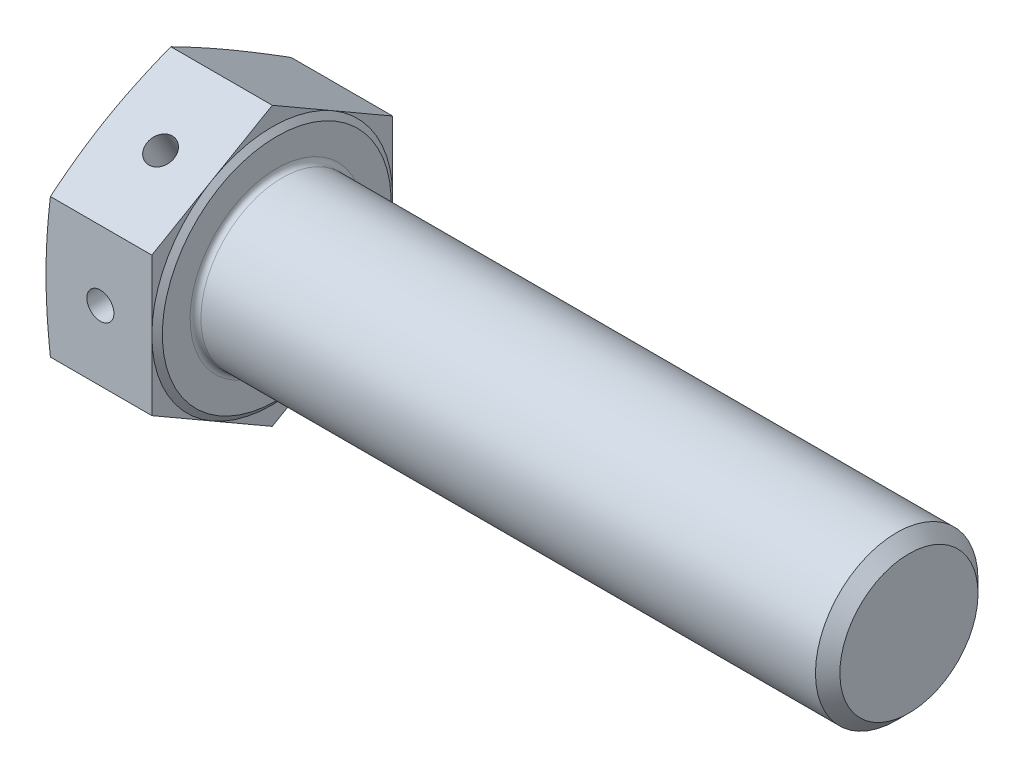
ISO-10303-21;
HEADER;
FILE_DESCRIPTION(('STEP AP214'),'2;1');
FILE_NAME('part.step','',(''),(''),'','','');
FILE_SCHEMA(('AUTOMOTIVE_DESIGN { 1 0 10303 214 1 1 1 1 }'));
ENDSEC;
DATA;
#1=APPLICATION_CONTEXT('core data for automotive mechanical design processes');
#2=APPLICATION_PROTOCOL_DEFINITION('international standard','automotive_design',2000,#1);
#3=PRODUCT_CONTEXT('',#1,'mechanical');
#4=PRODUCT('Part','Part','',(#3));
#5=PRODUCT_RELATED_PRODUCT_CATEGORY('part','',(#4));
#6=PRODUCT_DEFINITION_FORMATION('','',#4);
#7=PRODUCT_DEFINITION_CONTEXT('part definition',#1,'design');
#8=PRODUCT_DEFINITION('design','',#6,#7);
#9=PRODUCT_DEFINITION_SHAPE('','',#8);
#10=(LENGTH_UNIT() NAMED_UNIT(*) SI_UNIT(.MILLI.,.METRE.));
#11=(NAMED_UNIT(*) PLANE_ANGLE_UNIT() SI_UNIT($,.RADIAN.));
#12=(NAMED_UNIT(*) SI_UNIT($,.STERADIAN.) SOLID_ANGLE_UNIT());
#13=UNCERTAINTY_MEASURE_WITH_UNIT(LENGTH_MEASURE(1.E-05),#10,'distance_accuracy_value','');
#14=(GEOMETRIC_REPRESENTATION_CONTEXT(3) GLOBAL_UNCERTAINTY_ASSIGNED_CONTEXT((#13)) GLOBAL_UNIT_ASSIGNED_CONTEXT((#10,
#11,#12)) REPRESENTATION_CONTEXT('',''));
#15=CARTESIAN_POINT('',(0.,0.,0.));
#16=DIRECTION('',(0.,0.,1.));
#17=DIRECTION('',(1.,0.,0.));
#18=AXIS2_PLACEMENT_3D('',#15,#16,#17);
#19=CARTESIAN_POINT('',(6.02,0.,-13.335));
#20=DIRECTION('',(0.,0.,1.));
#21=DIRECTION('',(1.,0.,0.));
#22=AXIS2_PLACEMENT_3D('',#19,#20,#21);
#23=CYLINDRICAL_SURFACE('',#22,1.5);
#24=CARTESIAN_POINT('',(6.02,0.,13.335));
#25=DIRECTION('',(0.,0.,1.));
#26=DIRECTION('',(1.,0.,0.));
#27=AXIS2_PLACEMENT_3D('',#24,#25,#26);
#28=CIRCLE('',#27,1.5);
#29=CARTESIAN_POINT('',(7.52,0.,13.335));
#30=VERTEX_POINT('',#29);
#31=EDGE_CURVE('E584',#30,#30,#28,.T.);
#32=ORIENTED_EDGE('',*,*,#31,.T.);
#33=EDGE_LOOP('',(#32));
#34=FACE_BOUND('',#33,.T.);
#35=CARTESIAN_POINT('',(6.02,0.,0.));
#36=DIRECTION('',(0.,-0.866025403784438,0.500000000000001));
#37=DIRECTION('',(0.,0.500000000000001,0.866025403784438));
#38=AXIS2_PLACEMENT_3D('',#35,#36,#37);
#39=ELLIPSE('',#38,2.99999999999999,1.5);
#40=CARTESIAN_POINT('',(4.52,0.,0.));
#41=VERTEX_POINT('',#40);
#42=CARTESIAN_POINT('',(7.52,0.,0.));
#43=VERTEX_POINT('',#42);
#44=EDGE_CURVE('E46',#41,#43,#39,.F.);
#45=ORIENTED_EDGE('',*,*,#44,.T.);
#46=CARTESIAN_POINT('',(6.02,0.,0.));
#47=DIRECTION('',(0.,0.500000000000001,0.866025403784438));
#48=DIRECTION('',(0.,-0.866025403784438,0.500000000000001));
#49=AXIS2_PLACEMENT_3D('',#46,#47,#48);
#50=ELLIPSE('',#49,1.73205080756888,1.5);
#51=EDGE_CURVE('E11',#43,#41,#50,.F.);
#52=ORIENTED_EDGE('',*,*,#51,.T.);
#53=EDGE_LOOP('',(#45,#52));
#54=FACE_BOUND('',#53,.T.);
#55=ADVANCED_FACE('F32',(#34,#54),#23,.F.);
#56=CARTESIAN_POINT('',(12.22,0.,0.));
#57=DIRECTION('',(-1.,0.,0.));
#58=DIRECTION('',(0.,-1.,0.));
#59=AXIS2_PLACEMENT_3D('',#56,#57,#58);
#60=PLANE('',#59);
#61=CARTESIAN_POINT('',(12.22,0.,0.));
#62=DIRECTION('',(-1.,0.,0.));
#63=DIRECTION('',(0.,-1.,0.));
#64=AXIS2_PLACEMENT_3D('',#61,#62,#63);
#65=CIRCLE('',#64,9.6);
#66=CARTESIAN_POINT('',(12.22,-9.6,0.));
#67=VERTEX_POINT('',#66);
#68=EDGE_CURVE('E137',#67,#67,#65,.T.);
#69=ORIENTED_EDGE('',*,*,#68,.T.);
#70=EDGE_LOOP('',(#69));
#71=FACE_BOUND('',#70,.T.);
#72=CARTESIAN_POINT('',(12.22,0.,0.));
#73=DIRECTION('',(-1.,0.,0.));
#74=DIRECTION('',(0.,-1.,0.));
#75=AXIS2_PLACEMENT_3D('',#72,#73,#74);
#76=CIRCLE('',#75,12.67);
#77=CARTESIAN_POINT('',(12.22,-12.67,0.));
#78=VERTEX_POINT('',#77);
#79=EDGE_CURVE('E284',#78,#78,#76,.T.);
#80=ORIENTED_EDGE('',*,*,#79,.F.);
#81=EDGE_LOOP('',(#80));
#82=FACE_BOUND('',#81,.T.);
#83=ADVANCED_FACE('F239',(#71,#82),#60,.F.);
#84=CARTESIAN_POINT('',(11.72,-15.3979316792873,0.));
#85=DIRECTION('',(1.,0.,0.));
#86=DIRECTION('',(0.,0.,-1.));
#87=AXIS2_PLACEMENT_3D('',#84,#85,#86);
#88=PLANE('',#87);
#89=DIRECTION('',(0.,-0.5,-0.866025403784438));
#90=VECTOR('',#89,1.);
#91=CARTESIAN_POINT('',(11.72,-7.69896583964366,13.335));
#92=LINE('',#91,#90);
#93=CARTESIAN_POINT('',(11.72,-7.69896583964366,13.335));
#94=VERTEX_POINT('',#93);
#95=CARTESIAN_POINT('',(11.72,-11.5484487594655,6.6675));
#96=VERTEX_POINT('',#95);
#97=EDGE_CURVE('E197',#94,#96,#92,.T.);
#98=ORIENTED_EDGE('',*,*,#97,.T.);
#99=CARTESIAN_POINT('',(11.72,0.,0.));
#100=DIRECTION('',(-1.,0.,0.));
#101=DIRECTION('',(0.,-1.,0.));
#102=AXIS2_PLACEMENT_3D('',#99,#100,#101);
#103=CIRCLE('',#102,13.335);
#104=CARTESIAN_POINT('',(11.72,0.,13.335));
#105=VERTEX_POINT('',#104);
#106=EDGE_CURVE('E54',#96,#105,#103,.T.);
#107=ORIENTED_EDGE('',*,*,#106,.T.);
#108=DIRECTION('',(0.,-1.,0.));
#109=VECTOR('',#108,1.);
#110=CARTESIAN_POINT('',(11.72,7.69896583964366,13.335));
#111=LINE('',#110,#109);
#112=EDGE_CURVE('E180',#105,#94,#111,.T.);
#113=ORIENTED_EDGE('',*,*,#112,.T.);
#114=EDGE_LOOP('',(#98,#107,#113));
#115=FACE_BOUND('',#114,.T.);
#116=ADVANCED_FACE('F245',(#115),#88,.T.);
#117=CARTESIAN_POINT('',(11.72,7.69896583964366,13.335));
#118=VERTEX_POINT('',#117);
#119=EDGE_CURVE('E177',#118,#105,#111,.T.);
#120=ORIENTED_EDGE('',*,*,#119,.T.);
#121=CARTESIAN_POINT('',(11.72,11.5484487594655,6.6675));
#122=VERTEX_POINT('',#121);
#123=EDGE_CURVE('E153',#105,#122,#103,.T.);
#124=ORIENTED_EDGE('',*,*,#123,.T.);
#125=DIRECTION('',(0.,-0.5,0.866025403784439));
#126=VECTOR('',#125,1.);
#127=CARTESIAN_POINT('',(11.72,15.3979316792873,0.));
#128=LINE('',#127,#126);
#129=EDGE_CURVE('E184',#122,#118,#128,.T.);
#130=ORIENTED_EDGE('',*,*,#129,.T.);
#131=EDGE_LOOP('',(#120,#124,#130));
#132=FACE_BOUND('',#131,.T.);
#133=ADVANCED_FACE('F341',(#132),#88,.T.);
#134=CARTESIAN_POINT('',(11.72,15.3979316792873,0.));
#135=VERTEX_POINT('',#134);
#136=EDGE_CURVE('E181',#135,#122,#128,.T.);
#137=ORIENTED_EDGE('',*,*,#136,.T.);
#138=CARTESIAN_POINT('',(11.72,11.5484487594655,-6.6675));
#139=VERTEX_POINT('',#138);
#140=EDGE_CURVE('E346',#122,#139,#103,.T.);
#141=ORIENTED_EDGE('',*,*,#140,.T.);
#142=DIRECTION('',(0.,0.5,0.866025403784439));
#143=VECTOR('',#142,1.);
#144=CARTESIAN_POINT('',(11.72,7.69896583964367,-13.335));
#145=LINE('',#144,#143);
#146=EDGE_CURVE('E188',#139,#135,#145,.T.);
#147=ORIENTED_EDGE('',*,*,#146,.T.);
#148=EDGE_LOOP('',(#137,#141,#147));
#149=FACE_BOUND('',#148,.T.);
#150=ADVANCED_FACE('F345',(#149),#88,.T.);
#151=CARTESIAN_POINT('',(11.72,7.69896583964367,-13.335));
#152=VERTEX_POINT('',#151);
#153=EDGE_CURVE('E185',#152,#139,#145,.T.);
#154=ORIENTED_EDGE('',*,*,#153,.T.);
#155=CARTESIAN_POINT('',(11.72,0.,-13.335));
#156=VERTEX_POINT('',#155);
#157=EDGE_CURVE('E405',#139,#156,#103,.T.);
#158=ORIENTED_EDGE('',*,*,#157,.T.);
#159=DIRECTION('',(0.,1.,0.));
#160=VECTOR('',#159,1.);
#161=CARTESIAN_POINT('',(11.72,-7.69896583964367,-13.335));
#162=LINE('',#161,#160);
#163=EDGE_CURVE('E192',#156,#152,#162,.T.);
#164=ORIENTED_EDGE('',*,*,#163,.T.);
#165=EDGE_LOOP('',(#154,#158,#164));
#166=FACE_BOUND('',#165,.T.);
#167=ADVANCED_FACE('F398',(#166),#88,.T.);
#168=CARTESIAN_POINT('',(11.72,-7.69896583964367,-13.335));
#169=VERTEX_POINT('',#168);
#170=EDGE_CURVE('E189',#169,#156,#162,.T.);
#171=ORIENTED_EDGE('',*,*,#170,.T.);
#172=CARTESIAN_POINT('',(11.72,-11.5484487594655,-6.6675));
#173=VERTEX_POINT('',#172);
#174=EDGE_CURVE('E403',#156,#173,#103,.T.);
#175=ORIENTED_EDGE('',*,*,#174,.T.);
#176=DIRECTION('',(0.,0.5,-0.866025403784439));
#177=VECTOR('',#176,1.);
#178=CARTESIAN_POINT('',(11.72,-15.3979316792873,0.));
#179=LINE('',#178,#177);
#180=EDGE_CURVE('E196',#173,#169,#179,.T.);
#181=ORIENTED_EDGE('',*,*,#180,.T.);
#182=EDGE_LOOP('',(#171,#175,#181));
#183=FACE_BOUND('',#182,.T.);
#184=ADVANCED_FACE('F393',(#183),#88,.T.);
#185=CARTESIAN_POINT('',(11.72,-15.3979316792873,0.));
#186=VERTEX_POINT('',#185);
#187=EDGE_CURVE('E193',#186,#173,#179,.T.);
#188=ORIENTED_EDGE('',*,*,#187,.T.);
#189=EDGE_CURVE('E292',#173,#96,#103,.T.);
#190=ORIENTED_EDGE('',*,*,#189,.T.);
#191=EDGE_CURVE('E200',#96,#186,#92,.T.);
#192=ORIENTED_EDGE('',*,*,#191,.T.);
#193=EDGE_LOOP('',(#188,#190,#192));
#194=FACE_BOUND('',#193,.T.);
#195=ADVANCED_FACE('F234',(#194),#88,.T.);
#196=CARTESIAN_POINT('',(11.72,-7.69896583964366,13.335));
#197=DIRECTION('',(0.,0.866025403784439,-0.5));
#198=DIRECTION('',(0.,0.5,0.866025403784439));
#199=AXIS2_PLACEMENT_3D('',#196,#197,#198);
#200=PLANE('',#199);
#201=CARTESIAN_POINT('',(0.489014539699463,-15.3980471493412,-0.000199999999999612));
#202=CARTESIAN_POINT('',(0.413141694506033,-15.0780878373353,0.553985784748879));
#203=CARTESIAN_POINT('',(0.344298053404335,-14.7576728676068,1.10896079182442));
#204=CARTESIAN_POINT('',(0.223389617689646,-14.1159569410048,2.22044538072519));
#205=CARTESIAN_POINT('',(0.17133009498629,-13.7946557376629,2.77695538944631));
#206=CARTESIAN_POINT('',(0.0869324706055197,-13.1526949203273,3.88886414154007));
#207=CARTESIAN_POINT('',(0.0545154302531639,-12.8320379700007,4.44425827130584));
#208=CARTESIAN_POINT('',(0.0110507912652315,-12.1904035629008,5.55560166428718));
#209=CARTESIAN_POINT('',(0.,-11.8694261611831,6.11155083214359));
#210=CARTESIAN_POINT('',(0.,-11.2274713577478,7.22344916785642));
#211=CARTESIAN_POINT('',(0.0110507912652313,-10.9064939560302,7.77939833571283));
#212=CARTESIAN_POINT('',(0.0545154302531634,-10.2648595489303,8.89074172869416));
#213=CARTESIAN_POINT('',(0.0869324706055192,-9.9442025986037,9.44613585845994));
#214=CARTESIAN_POINT('',(0.171330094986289,-9.30224178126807,10.5580446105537));
#215=CARTESIAN_POINT('',(0.223389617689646,-8.98094057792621,11.1145546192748));
#216=CARTESIAN_POINT('',(0.344298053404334,-8.33922465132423,12.2260392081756));
#217=CARTESIAN_POINT('',(0.413141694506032,-8.01880968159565,12.7810142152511));
#218=CARTESIAN_POINT('',(0.489014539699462,-7.69885036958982,13.3352));
#219=B_SPLINE_CURVE_WITH_KNOTS('',3,(#201,#202,#203,#204,#205,#206,#207,#208,#209,#210,#211,
#212,#213,#214,#215,#216,#217,#218),.UNSPECIFIED.,.F.,.F.,(4,2,2,2,2,2,2,2,4),(0.,
1.93328057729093,3.86716780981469,5.79323073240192,7.71900583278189,9.64478093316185,
11.5708438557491,13.5047310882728,15.4380116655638),.UNSPECIFIED.);
#220=CARTESIAN_POINT('',(0.488987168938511,-15.3979316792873,0.));
#221=VERTEX_POINT('',#220);
#222=CARTESIAN_POINT('',(0.,-11.5484487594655,6.6675));
#223=VERTEX_POINT('',#222);
#224=EDGE_CURVE('E356',#221,#223,#219,.T.);
#225=ORIENTED_EDGE('',*,*,#224,.F.);
#226=DIRECTION('',(-1.,0.,0.));
#227=VECTOR('',#226,1.);
#228=CARTESIAN_POINT('',(11.72,-15.3979316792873,0.));
#229=LINE('',#228,#227);
#230=EDGE_CURVE('E158',#186,#221,#229,.T.);
#231=ORIENTED_EDGE('',*,*,#230,.F.);
#232=ORIENTED_EDGE('',*,*,#191,.F.);
#233=ORIENTED_EDGE('',*,*,#97,.F.);
#234=DIRECTION('',(-1.,0.,0.));
#235=VECTOR('',#234,1.);
#236=CARTESIAN_POINT('',(11.72,-7.69896583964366,13.335));
#237=LINE('',#236,#235);
#238=CARTESIAN_POINT('',(0.488987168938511,-7.69896583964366,13.335));
#239=VERTEX_POINT('',#238);
#240=EDGE_CURVE('E174',#94,#239,#237,.T.);
#241=ORIENTED_EDGE('',*,*,#240,.T.);
#242=EDGE_CURVE('E333',#223,#239,#219,.T.);
#243=ORIENTED_EDGE('',*,*,#242,.F.);
#244=EDGE_LOOP('',(#225,#231,#232,#233,#241,#243));
#245=FACE_BOUND('',#244,.T.);
#246=ADVANCED_FACE('F34',(#245),#200,.F.);
#247=CARTESIAN_POINT('',(11.72,-15.3979316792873,0.));
#248=DIRECTION('',(0.,0.866025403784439,0.5));
#249=DIRECTION('',(0.,-0.5,0.866025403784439));
#250=AXIS2_PLACEMENT_3D('',#247,#248,#249);
#251=PLANE('',#250);
#252=CARTESIAN_POINT('',(6.02,-11.5484487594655,-6.66749999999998));
#253=DIRECTION('',(0.,0.866025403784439,0.5));
#254=DIRECTION('',(0.,-0.5,0.866025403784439));
#255=AXIS2_PLACEMENT_3D('',#252,#253,#254);
#256=CIRCLE('',#255,1.5);
#257=CARTESIAN_POINT('',(6.02,-12.2984487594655,-5.36846189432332));
#258=VERTEX_POINT('',#257);
#259=EDGE_CURVE('E582',#258,#258,#256,.T.);
#260=ORIENTED_EDGE('',*,*,#259,.T.);
#261=EDGE_LOOP('',(#260));
#262=FACE_BOUND('',#261,.T.);
#263=CARTESIAN_POINT('',(0.489014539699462,-7.69885036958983,-13.3352));
#264=CARTESIAN_POINT('',(0.413141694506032,-8.01880968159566,-12.7810142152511));
#265=CARTESIAN_POINT('',(0.344298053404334,-8.33922465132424,-12.2260392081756));
#266=CARTESIAN_POINT('',(0.223389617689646,-8.98094057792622,-11.1145546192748));
#267=CARTESIAN_POINT('',(0.17133009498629,-9.30224178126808,-10.5580446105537));
#268=CARTESIAN_POINT('',(0.0869324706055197,-9.94420259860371,-9.44613585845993));
#269=CARTESIAN_POINT('',(0.0545154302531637,-10.2648595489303,-8.89074172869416));
#270=CARTESIAN_POINT('',(0.0110507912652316,-10.9064939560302,-7.77939833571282));
#271=CARTESIAN_POINT('',(0.,-11.2274713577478,-7.22344916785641));
#272=CARTESIAN_POINT('',(0.,-11.8694261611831,-6.11155083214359));
#273=CARTESIAN_POINT('',(0.0110507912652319,-12.1904035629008,-5.55560166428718));
#274=CARTESIAN_POINT('',(0.0545154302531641,-12.8320379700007,-4.44425827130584));
#275=CARTESIAN_POINT('',(0.08693247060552,-13.1526949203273,-3.88886414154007));
#276=CARTESIAN_POINT('',(0.17133009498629,-13.7946557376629,-2.77695538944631));
#277=CARTESIAN_POINT('',(0.223389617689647,-14.1159569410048,-2.22044538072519));
#278=CARTESIAN_POINT('',(0.344298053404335,-14.7576728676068,-1.10896079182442));
#279=CARTESIAN_POINT('',(0.413141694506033,-15.0780878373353,-0.553985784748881));
#280=CARTESIAN_POINT('',(0.489014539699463,-15.3980471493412,0.000199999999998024));
#281=B_SPLINE_CURVE_WITH_KNOTS('',3,(#263,#264,#265,#266,#267,#268,#269,#270,#271,#272,#273,
#274,#275,#276,#277,#278,#279,#280),.UNSPECIFIED.,.F.,.F.,(4,2,2,2,2,2,2,2,4),(0.,
1.93328057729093,3.86716780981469,5.79323073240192,7.71900583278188,9.64478093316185,
11.5708438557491,13.5047310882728,15.4380116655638),.UNSPECIFIED.);
#282=CARTESIAN_POINT('',(0.488987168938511,-7.69896583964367,-13.335));
#283=VERTEX_POINT('',#282);
#284=CARTESIAN_POINT('',(0.,-11.5484487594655,-6.6675));
#285=VERTEX_POINT('',#284);
#286=EDGE_CURVE('E355',#283,#285,#281,.T.);
#287=ORIENTED_EDGE('',*,*,#286,.F.);
#288=DIRECTION('',(-1.,0.,0.));
#289=VECTOR('',#288,1.);
#290=CARTESIAN_POINT('',(11.72,-7.69896583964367,-13.335));
#291=LINE('',#290,#289);
#292=EDGE_CURVE('E162',#169,#283,#291,.T.);
#293=ORIENTED_EDGE('',*,*,#292,.F.);
#294=ORIENTED_EDGE('',*,*,#180,.F.);
#295=ORIENTED_EDGE('',*,*,#187,.F.);
#296=ORIENTED_EDGE('',*,*,#230,.T.);
#297=EDGE_CURVE('E210',#285,#221,#281,.T.);
#298=ORIENTED_EDGE('',*,*,#297,.F.);
#299=EDGE_LOOP('',(#287,#293,#294,#295,#296,#298));
#300=FACE_BOUND('',#299,.T.);
#301=ADVANCED_FACE('F224',(#262,#300),#251,.F.);
#302=CARTESIAN_POINT('',(11.72,-7.69896583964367,-13.335));
#303=DIRECTION('',(0.,0.,1.));
#304=DIRECTION('',(0.,-1.,0.));
#305=AXIS2_PLACEMENT_3D('',#302,#303,#304);
#306=PLANE('',#305);
#307=CARTESIAN_POINT('',(6.02,0.,-13.335));
#308=DIRECTION('',(0.,0.,1.));
#309=DIRECTION('',(1.,0.,0.));
#310=AXIS2_PLACEMENT_3D('',#307,#308,#309);
#311=CIRCLE('',#310,1.5);
#312=CARTESIAN_POINT('',(7.52,0.,-13.335));
#313=VERTEX_POINT('',#312);
#314=EDGE_CURVE('E290',#313,#313,#311,.T.);
#315=ORIENTED_EDGE('',*,*,#314,.T.);
#316=EDGE_LOOP('',(#315));
#317=FACE_BOUND('',#316,.T.);
#318=CARTESIAN_POINT('',(2.60532413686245,-20.3456813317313,-13.335));
#319=CARTESIAN_POINT('',(2.48541877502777,-19.7406954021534,-13.335));
#320=CARTESIAN_POINT('',(2.36700006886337,-19.1354094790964,-13.335));
#321=CARTESIAN_POINT('',(2.13393244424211,-17.9240916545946,-13.335));
#322=CARTESIAN_POINT('',(2.01928365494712,-17.3180597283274,-13.335));
#323=CARTESIAN_POINT('',(1.79447414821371,-16.1046783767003,-13.335));
#324=CARTESIAN_POINT('',(1.68431695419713,-15.4973282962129,-13.335));
#325=CARTESIAN_POINT('',(1.46965608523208,-14.2816304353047,-13.335));
#326=CARTESIAN_POINT('',(1.36515237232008,-13.6732826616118,-13.335));
#327=CARTESIAN_POINT('',(1.16375472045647,-12.4591814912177,-13.335));
#328=CARTESIAN_POINT('',(1.06681778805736,-11.8534352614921,-13.335));
#329=CARTESIAN_POINT('',(0.881473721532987,-10.6406288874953,-13.335));
#330=CARTESIAN_POINT('',(0.793066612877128,-10.0335687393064,-13.335));
#331=CARTESIAN_POINT('',(0.626764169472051,-8.81806592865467,-13.335));
#332=CARTESIAN_POINT('',(0.548867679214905,-8.20962342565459,-13.335));
#333=CARTESIAN_POINT('',(0.405860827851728,-6.99122091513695,-13.335));
#334=CARTESIAN_POINT('',(0.340750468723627,-6.38126090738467,-13.335));
#335=CARTESIAN_POINT('',(0.225273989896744,-5.15454122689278,-13.335));
#336=CARTESIAN_POINT('',(0.175041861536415,-4.53776875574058,-13.335));
#337=CARTESIAN_POINT('',(0.0924956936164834,-3.3030155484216,-13.335));
#338=CARTESIAN_POINT('',(0.060181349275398,-2.68503483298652,-13.335));
#339=CARTESIAN_POINT('',(0.0152982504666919,-1.44855593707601,-13.335));
#340=CARTESIAN_POINT('',(0.0027226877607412,-0.830058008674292,-13.335));
#341=CARTESIAN_POINT('',(-0.00192744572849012,0.407015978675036,-13.335));
#342=CARTESIAN_POINT('',(0.0059979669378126,1.02559203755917,-13.335));
#343=CARTESIAN_POINT('',(0.0419065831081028,2.26390769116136,-13.335));
#344=CARTESIAN_POINT('',(0.0699466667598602,2.88364560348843,-13.335));
#345=CARTESIAN_POINT('',(0.144515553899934,4.12199778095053,-13.335));
#346=CARTESIAN_POINT('',(0.191044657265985,4.74061202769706,-13.335));
#347=CARTESIAN_POINT('',(0.300285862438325,5.97669518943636,-13.335));
#348=CARTESIAN_POINT('',(0.363005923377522,6.59416339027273,-13.335));
#349=CARTESIAN_POINT('',(0.502063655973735,7.82754786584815,-13.335));
#350=CARTESIAN_POINT('',(0.57840136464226,8.44346413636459,-13.335));
#351=CARTESIAN_POINT('',(0.737144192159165,9.6352734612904,-13.335));
#352=CARTESIAN_POINT('',(0.818870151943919,10.2112578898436,-13.335));
#353=CARTESIAN_POINT('',(0.990417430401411,11.3620259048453,-13.335));
#354=CARTESIAN_POINT('',(1.08023892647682,11.9368094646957,-13.335));
#355=CARTESIAN_POINT('',(1.26651254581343,13.0853438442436,-13.335));
#356=CARTESIAN_POINT('',(1.36296520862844,13.6590945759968,-13.335));
#357=CARTESIAN_POINT('',(1.56128970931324,14.8056509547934,-13.335));
#358=CARTESIAN_POINT('',(1.66316150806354,15.3784566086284,-13.335));
#359=CARTESIAN_POINT('',(1.87137281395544,16.5233811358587,-13.335));
#360=CARTESIAN_POINT('',(1.97771328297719,17.095499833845,-13.335));
#361=CARTESIAN_POINT('',(2.19406645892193,18.2390434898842,-13.335));
#362=CARTESIAN_POINT('',(2.30407918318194,18.8104684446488,-13.335));
#363=CARTESIAN_POINT('',(2.63864080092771,20.5237950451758,-13.335));
#364=CARTESIAN_POINT('',(2.86772463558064,21.6648108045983,-13.335));
#365=CARTESIAN_POINT('',(3.33254163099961,23.9363445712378,-13.335));
#366=CARTESIAN_POINT('',(3.56821018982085,25.0668758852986,-13.335));
#367=CARTESIAN_POINT('',(4.04557716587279,27.3266797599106,-13.335));
#368=CARTESIAN_POINT('',(4.28727567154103,28.4559523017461,-13.335));
#369=CARTESIAN_POINT('',(4.7748852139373,30.7123737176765,-13.335));
#370=CARTESIAN_POINT('',(5.02079167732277,31.8395235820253,-13.335));
#371=CARTESIAN_POINT('',(5.39218586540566,33.5296749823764,-13.335));
#372=CARTESIAN_POINT('',(5.51640470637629,34.0929558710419,-13.335));
#373=CARTESIAN_POINT('',(5.76559040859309,35.21935167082,-13.335));
#374=CARTESIAN_POINT('',(5.89055726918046,35.7824665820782,-13.335));
#375=CARTESIAN_POINT('',(6.01584932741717,36.3455091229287,-13.335));
#376=B_SPLINE_CURVE_WITH_KNOTS('',3,(#318,#319,#320,#321,#322,#323,#324,#325,#326,#327,#328,
#329,#330,#331,#332,#333,#334,#335,#336,#337,#338,#339,#340,#341,#342,#343,#344,#345,#346,#347,
#348,#349,#350,#351,#352,#353,#354,#355,#356,#357,#358,#359,#360,#361,#362,#363,#364,#365,#366,
#367,#368,#369,#370,#371,#372,#373,#374,#375),.UNSPECIFIED.,.F.,.F.,(4,2,2,2,2,2,2,2,2,2,2,2,2,
2,2,2,2,2,2,2,2,2,2,2,2,2,2,2,4),(0.,1.85026744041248,3.70059820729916,5.55235358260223,
7.40409652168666,9.24440849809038,11.084725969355,12.9248409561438,14.764956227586,
16.6211718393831,18.4773558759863,20.3328995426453,22.1884417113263,24.0492517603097,
25.9100919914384,27.7718487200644,29.6336105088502,31.3788033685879,33.124034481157,
34.8694077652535,36.614768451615,38.3605067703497,40.1062533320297,43.597556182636,
47.0620378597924,50.5265703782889,53.9875506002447,55.7179955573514,57.4484389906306),.UNSPECIFIED.);
#377=CARTESIAN_POINT('',(0.488987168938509,7.69896583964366,-13.335));
#378=VERTEX_POINT('',#377);
#379=CARTESIAN_POINT('',(0.,0.,-13.335));
#380=VERTEX_POINT('',#379);
#381=EDGE_CURVE('E208',#378,#380,#376,.F.);
#382=ORIENTED_EDGE('',*,*,#381,.F.);
#383=DIRECTION('',(-1.,0.,0.));
#384=VECTOR('',#383,1.);
#385=CARTESIAN_POINT('',(11.72,7.69896583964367,-13.335));
#386=LINE('',#385,#384);
#387=EDGE_CURVE('E165',#152,#378,#386,.T.);
#388=ORIENTED_EDGE('',*,*,#387,.F.);
#389=ORIENTED_EDGE('',*,*,#163,.F.);
#390=ORIENTED_EDGE('',*,*,#170,.F.);
#391=ORIENTED_EDGE('',*,*,#292,.T.);
#392=EDGE_CURVE('E201',#380,#283,#376,.F.);
#393=ORIENTED_EDGE('',*,*,#392,.F.);
#394=EDGE_LOOP('',(#382,#388,#389,#390,#391,#393));
#395=FACE_BOUND('',#394,.T.);
#396=ADVANCED_FACE('F219',(#317,#395),#306,.F.);
#397=CARTESIAN_POINT('',(11.72,7.69896583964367,-13.335));
#398=DIRECTION('',(0.,-0.866025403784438,0.5));
#399=DIRECTION('',(0.,-0.5,-0.866025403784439));
#400=AXIS2_PLACEMENT_3D('',#397,#398,#399);
#401=PLANE('',#400);
#402=CARTESIAN_POINT('',(0.489014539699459,15.3980471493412,0.000199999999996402));
#403=CARTESIAN_POINT('',(0.413141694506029,15.0780878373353,-0.553985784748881));
#404=CARTESIAN_POINT('',(0.344298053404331,14.7576728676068,-1.10896079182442));
#405=CARTESIAN_POINT('',(0.223389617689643,14.1159569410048,-2.22044538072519));
#406=CARTESIAN_POINT('',(0.171330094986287,13.7946557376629,-2.77695538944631));
#407=CARTESIAN_POINT('',(0.0869324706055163,13.1526949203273,-3.88886414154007));
#408=CARTESIAN_POINT('',(0.0545154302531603,12.8320379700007,-4.44425827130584));
#409=CARTESIAN_POINT('',(0.0110507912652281,12.1904035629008,-5.55560166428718));
#410=CARTESIAN_POINT('',(0.,11.8694261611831,-6.11155083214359));
#411=CARTESIAN_POINT('',(0.,11.2274713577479,-7.22344916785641));
#412=CARTESIAN_POINT('',(0.0110507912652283,10.9064939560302,-7.77939833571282));
#413=CARTESIAN_POINT('',(0.0545154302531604,10.2648595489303,-8.89074172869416));
#414=CARTESIAN_POINT('',(0.0869324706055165,9.94420259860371,-9.44613585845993));
#415=CARTESIAN_POINT('',(0.171330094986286,9.30224178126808,-10.5580446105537));
#416=CARTESIAN_POINT('',(0.223389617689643,8.98094057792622,-11.1145546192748));
#417=CARTESIAN_POINT('',(0.344298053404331,8.33922465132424,-12.2260392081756));
#418=CARTESIAN_POINT('',(0.413141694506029,8.01880968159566,-12.7810142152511));
#419=CARTESIAN_POINT('',(0.489014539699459,7.69885036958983,-13.3352));
#420=B_SPLINE_CURVE_WITH_KNOTS('',3,(#402,#403,#404,#405,#406,#407,#408,#409,#410,#411,#412,
#413,#414,#415,#416,#417,#418,#419),.UNSPECIFIED.,.F.,.F.,(4,2,2,2,2,2,2,2,4),(0.,
1.93328057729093,3.86716780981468,5.79323073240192,7.71900583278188,9.64478093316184,
11.5708438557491,13.5047310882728,15.4380116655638),.UNSPECIFIED.);
#421=CARTESIAN_POINT('',(0.488987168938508,15.3979316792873,0.));
#422=VERTEX_POINT('',#421);
#423=CARTESIAN_POINT('',(0.,11.5484487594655,-6.66750000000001));
#424=VERTEX_POINT('',#423);
#425=EDGE_CURVE('E352',#422,#424,#420,.T.);
#426=ORIENTED_EDGE('',*,*,#425,.F.);
#427=DIRECTION('',(-1.,0.,0.));
#428=VECTOR('',#427,1.);
#429=CARTESIAN_POINT('',(11.72,15.3979316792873,0.));
#430=LINE('',#429,#428);
#431=EDGE_CURVE('E168',#135,#422,#430,.T.);
#432=ORIENTED_EDGE('',*,*,#431,.F.);
#433=ORIENTED_EDGE('',*,*,#146,.F.);
#434=ORIENTED_EDGE('',*,*,#153,.F.);
#435=ORIENTED_EDGE('',*,*,#387,.T.);
#436=EDGE_CURVE('E209',#424,#378,#420,.T.);
#437=ORIENTED_EDGE('',*,*,#436,.F.);
#438=EDGE_LOOP('',(#426,#432,#433,#434,#435,#437));
#439=FACE_BOUND('',#438,.T.);
#440=ADVANCED_FACE('F223',(#439),#401,.F.);
#441=CARTESIAN_POINT('',(11.72,15.3979316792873,0.));
#442=DIRECTION('',(0.,-0.866025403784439,-0.5));
#443=DIRECTION('',(0.,0.5,-0.866025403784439));
#444=AXIS2_PLACEMENT_3D('',#441,#442,#443);
#445=PLANE('',#444);
#446=CARTESIAN_POINT('',(6.02,11.5484487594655,6.66749999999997));
#447=DIRECTION('',(0.,-0.866025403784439,-0.5));
#448=DIRECTION('',(0.,0.5,-0.866025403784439));
#449=AXIS2_PLACEMENT_3D('',#446,#447,#448);
#450=CIRCLE('',#449,1.5);
#451=CARTESIAN_POINT('',(6.02,12.2984487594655,5.36846189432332));
#452=VERTEX_POINT('',#451);
#453=EDGE_CURVE('E323',#452,#452,#450,.T.);
#454=ORIENTED_EDGE('',*,*,#453,.T.);
#455=EDGE_LOOP('',(#454));
#456=FACE_BOUND('',#455,.T.);
#457=CARTESIAN_POINT('',(0.48901453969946,7.69885036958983,13.3352));
#458=CARTESIAN_POINT('',(0.41314169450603,8.01880968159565,12.7810142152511));
#459=CARTESIAN_POINT('',(0.344298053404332,8.33922465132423,12.2260392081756));
#460=CARTESIAN_POINT('',(0.223389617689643,8.98094057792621,11.1145546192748));
#461=CARTESIAN_POINT('',(0.171330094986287,9.30224178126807,10.5580446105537));
#462=CARTESIAN_POINT('',(0.0869324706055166,9.9442025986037,9.44613585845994));
#463=CARTESIAN_POINT('',(0.0545154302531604,10.2648595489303,8.89074172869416));
#464=CARTESIAN_POINT('',(0.0110507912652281,10.9064939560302,7.77939833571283));
#465=CARTESIAN_POINT('',(0.,11.2274713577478,7.22344916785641));
#466=CARTESIAN_POINT('',(0.,11.8694261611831,6.11155083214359));
#467=CARTESIAN_POINT('',(0.0110507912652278,12.1904035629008,5.55560166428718));
#468=CARTESIAN_POINT('',(0.0545154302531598,12.8320379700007,4.44425827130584));
#469=CARTESIAN_POINT('',(0.0869324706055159,13.1526949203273,3.88886414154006));
#470=CARTESIAN_POINT('',(0.171330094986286,13.7946557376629,2.77695538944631));
#471=CARTESIAN_POINT('',(0.223389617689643,14.1159569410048,2.22044538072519));
#472=CARTESIAN_POINT('',(0.344298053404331,14.7576728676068,1.10896079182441));
#473=CARTESIAN_POINT('',(0.413141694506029,15.0780878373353,0.553985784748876));
#474=CARTESIAN_POINT('',(0.489014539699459,15.3980471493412,-0.000200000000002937));
#475=B_SPLINE_CURVE_WITH_KNOTS('',3,(#457,#458,#459,#460,#461,#462,#463,#464,#465,#466,#467,
#468,#469,#470,#471,#472,#473,#474),.UNSPECIFIED.,.F.,.F.,(4,2,2,2,2,2,2,2,4),(0.,
1.93328057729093,3.86716780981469,5.79323073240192,7.71900583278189,9.64478093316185,
11.5708438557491,13.5047310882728,15.4380116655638),.UNSPECIFIED.);
#476=CARTESIAN_POINT('',(0.488987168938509,7.69896583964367,13.335));
#477=VERTEX_POINT('',#476);
#478=CARTESIAN_POINT('',(0.,11.5484487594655,6.66749999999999));
#479=VERTEX_POINT('',#478);
#480=EDGE_CURVE('E301',#477,#479,#475,.T.);
#481=ORIENTED_EDGE('',*,*,#480,.F.);
#482=DIRECTION('',(-1.,0.,0.));
#483=VECTOR('',#482,1.);
#484=CARTESIAN_POINT('',(11.72,7.69896583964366,13.335));
#485=LINE('',#484,#483);
#486=EDGE_CURVE('E171',#118,#477,#485,.T.);
#487=ORIENTED_EDGE('',*,*,#486,.F.);
#488=ORIENTED_EDGE('',*,*,#129,.F.);
#489=ORIENTED_EDGE('',*,*,#136,.F.);
#490=ORIENTED_EDGE('',*,*,#431,.T.);
#491=EDGE_CURVE('E329',#479,#422,#475,.T.);
#492=ORIENTED_EDGE('',*,*,#491,.F.);
#493=EDGE_LOOP('',(#481,#487,#488,#489,#490,#492));
#494=FACE_BOUND('',#493,.T.);
#495=ADVANCED_FACE('F311',(#456,#494),#445,.F.);
#496=CARTESIAN_POINT('',(11.72,7.69896583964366,13.335));
#497=DIRECTION('',(0.,0.,-1.));
#498=DIRECTION('',(-1.,0.,0.));
#499=AXIS2_PLACEMENT_3D('',#496,#497,#498);
#500=PLANE('',#499);
#501=ORIENTED_EDGE('',*,*,#31,.F.);
#502=EDGE_LOOP('',(#501));
#503=FACE_BOUND('',#502,.T.);
#504=CARTESIAN_POINT('',(2.60532392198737,-20.3456802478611,13.335));
#505=CARTESIAN_POINT('',(2.48541857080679,-19.7406943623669,13.335));
#506=CARTESIAN_POINT('',(2.36699987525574,-19.1354084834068,13.335));
#507=CARTESIAN_POINT('',(2.13393227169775,-17.9240907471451,13.335));
#508=CARTESIAN_POINT('',(2.01928349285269,-17.318058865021,13.335));
#509=CARTESIAN_POINT('',(1.79447400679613,-16.1046776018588,13.335));
#510=CARTESIAN_POINT('',(1.68431682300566,-15.4973275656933,13.335));
#511=CARTESIAN_POINT('',(1.4696559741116,-14.281629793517,13.335));
#512=CARTESIAN_POINT('',(1.36515227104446,-13.6732820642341,13.335));
#513=CARTESIAN_POINT('',(1.16375463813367,-12.4591809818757,13.335));
#514=CARTESIAN_POINT('',(1.06681771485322,-11.8534347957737,13.335));
#515=CARTESIAN_POINT('',(0.881473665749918,-10.6406285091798,13.335));
#516=CARTESIAN_POINT('',(0.793066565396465,-10.03356840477,13.335));
#517=CARTESIAN_POINT('',(0.626764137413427,-8.81806568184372,13.335));
#518=CARTESIAN_POINT('',(0.548867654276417,-8.20962322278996,13.335));
#519=CARTESIAN_POINT('',(0.405860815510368,-6.99122080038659,13.335));
#520=CARTESIAN_POINT('',(0.340750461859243,-6.38126083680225,13.335));
#521=CARTESIAN_POINT('',(0.225273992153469,-5.15454124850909,13.335));
#522=CARTESIAN_POINT('',(0.175041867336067,-4.53776882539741,13.335));
#523=CARTESIAN_POINT('',(0.0924957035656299,-3.30301571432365,13.335));
#524=CARTESIAN_POINT('',(0.0601813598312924,-2.68503504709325,13.335));
#525=CARTESIAN_POINT('',(0.0152982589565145,-1.44855624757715,13.335));
#526=CARTESIAN_POINT('',(0.00272269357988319,-0.830058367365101,13.335));
#527=CARTESIAN_POINT('',(-0.00192744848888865,0.407015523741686,13.335));
#528=CARTESIAN_POINT('',(0.00599795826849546,1.02559153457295,13.335));
#529=CARTESIAN_POINT('',(0.0419065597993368,2.26390709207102,13.335));
#530=CARTESIAN_POINT('',(0.0699466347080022,2.88364495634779,13.335));
#531=CARTESIAN_POINT('',(0.144515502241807,4.12199703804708,13.335));
#532=CARTESIAN_POINT('',(0.191044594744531,4.74061123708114,13.335));
#533=CARTESIAN_POINT('',(0.300285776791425,5.97669430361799,13.335));
#534=CARTESIAN_POINT('',(0.363005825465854,6.59416245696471,13.335));
#535=CARTESIAN_POINT('',(0.502063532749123,7.82754683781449,13.335));
#536=CARTESIAN_POINT('',(0.578401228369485,8.44346306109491,13.335));
#537=CARTESIAN_POINT('',(0.737144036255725,9.63527233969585,13.335));
#538=CARTESIAN_POINT('',(0.818869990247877,10.2112567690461,13.335));
#539=CARTESIAN_POINT('',(0.990417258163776,11.3620247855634,13.335));
#540=CARTESIAN_POINT('',(1.08023874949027,11.9368083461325,13.335));
#541=CARTESIAN_POINT('',(1.26651236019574,13.0853427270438,13.335));
#542=CARTESIAN_POINT('',(1.36296501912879,13.6590934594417,13.335));
#543=CARTESIAN_POINT('',(1.56128951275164,14.8056498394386,13.335));
#544=CARTESIAN_POINT('',(1.66316130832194,15.3784554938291,13.335));
#545=CARTESIAN_POINT('',(1.87137260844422,16.5233800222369,13.335));
#546=CARTESIAN_POINT('',(1.9777130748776,17.0954987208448,13.335));
#547=CARTESIAN_POINT('',(2.19406624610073,18.2390423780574,13.335));
#548=CARTESIAN_POINT('',(2.30407896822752,18.8104673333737,13.335));
#549=CARTESIAN_POINT('',(2.63864058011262,20.5237939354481,13.335));
#550=CARTESIAN_POINT('',(2.86772441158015,21.6648096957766,13.335));
#551=CARTESIAN_POINT('',(3.33254140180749,23.9363434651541,13.335));
#552=CARTESIAN_POINT('',(3.56820995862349,25.0668747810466,13.335));
#553=CARTESIAN_POINT('',(4.04557693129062,27.326678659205,13.335));
#554=CARTESIAN_POINT('',(4.28727543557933,28.4559512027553,13.335));
#555=CARTESIAN_POINT('',(4.7748849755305,30.7123726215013,13.335));
#556=CARTESIAN_POINT('',(5.02079143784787,31.8395224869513,13.335));
#557=CARTESIAN_POINT('',(5.39218562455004,33.5296738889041,13.335));
#558=CARTESIAN_POINT('',(5.51640446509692,34.0929547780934,13.335));
#559=CARTESIAN_POINT('',(5.76559016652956,35.2193505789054,13.335));
#560=CARTESIAN_POINT('',(5.8905570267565,35.782465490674,13.335));
#561=CARTESIAN_POINT('',(6.0158490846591,36.3455080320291,13.335));
#562=B_SPLINE_CURVE_WITH_KNOTS('',3,(#504,#505,#506,#507,#508,#509,#510,#511,#512,#513,#514,
#515,#516,#517,#518,#519,#520,#521,#522,#523,#524,#525,#526,#527,#528,#529,#530,#531,#532,#533,
#534,#535,#536,#537,#538,#539,#540,#541,#542,#543,#544,#545,#546,#547,#548,#549,#550,#551,#552,
#553,#554,#555,#556,#557,#558,#559,#560,#561),.UNSPECIFIED.,.F.,.F.,(4,2,2,2,2,2,2,2,2,2,2,2,2,
2,2,2,2,2,2,2,2,2,2,2,2,2,2,2,4),(0.,1.85026730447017,3.70059793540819,5.55235317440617,
7.40409597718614,9.2444078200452,11.084725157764,12.9248400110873,14.7649551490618,
16.6211706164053,18.4773545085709,20.3328980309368,22.1884400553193,24.0492499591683,
25.9100900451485,27.771846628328,29.6336082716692,31.3788011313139,33.1240322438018,
34.8694055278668,36.6147662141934,38.360504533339,40.1062510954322,43.59755394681,
47.062035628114,50.5265681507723,53.9875483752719,55.7179933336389,57.4484367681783),.UNSPECIFIED.);
#563=CARTESIAN_POINT('',(0.,0.,13.335));
#564=VERTEX_POINT('',#563);
#565=EDGE_CURVE('E300',#239,#564,#562,.T.);
#566=ORIENTED_EDGE('',*,*,#565,.F.);
#567=ORIENTED_EDGE('',*,*,#240,.F.);
#568=ORIENTED_EDGE('',*,*,#112,.F.);
#569=ORIENTED_EDGE('',*,*,#119,.F.);
#570=ORIENTED_EDGE('',*,*,#486,.T.);
#571=EDGE_CURVE('E288',#564,#477,#562,.T.);
#572=ORIENTED_EDGE('',*,*,#571,.F.);
#573=EDGE_LOOP('',(#566,#567,#568,#569,#570,#572));
#574=FACE_BOUND('',#573,.T.);
#575=ADVANCED_FACE('F306',(#503,#574),#500,.F.);
#576=CARTESIAN_POINT('',(0.,0.,0.));
#577=DIRECTION('',(1.,0.,0.));
#578=DIRECTION('',(0.,1.,0.));
#579=AXIS2_PLACEMENT_3D('',#576,#577,#578);
#580=CONICAL_SURFACE('',#579,13.335,1.33805667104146);
#581=ORIENTED_EDGE('',*,*,#392,.T.);
#582=ORIENTED_EDGE('',*,*,#286,.T.);
#583=CARTESIAN_POINT('',(0.,0.,0.));
#584=DIRECTION('',(1.,0.,0.));
#585=DIRECTION('',(0.,0.,-1.));
#586=AXIS2_PLACEMENT_3D('',#583,#584,#585);
#587=CIRCLE('',#586,13.335);
#588=EDGE_CURVE('E154',#285,#380,#587,.T.);
#589=ORIENTED_EDGE('',*,*,#588,.T.);
#590=EDGE_LOOP('',(#581,#582,#589));
#591=FACE_BOUND('',#590,.T.);
#592=ADVANCED_FACE('F310',(#591),#580,.T.);
#593=ORIENTED_EDGE('',*,*,#297,.T.);
#594=ORIENTED_EDGE('',*,*,#224,.T.);
#595=EDGE_CURVE('E157',#223,#285,#587,.T.);
#596=ORIENTED_EDGE('',*,*,#595,.T.);
#597=EDGE_LOOP('',(#593,#594,#596));
#598=FACE_BOUND('',#597,.T.);
#599=ADVANCED_FACE('F377',(#598),#580,.T.);
#600=ORIENTED_EDGE('',*,*,#242,.T.);
#601=ORIENTED_EDGE('',*,*,#565,.T.);
#602=CARTESIAN_POINT('',(0.,0.,0.));
#603=DIRECTION('',(-1.,0.,0.));
#604=DIRECTION('',(0.,-1.,0.));
#605=AXIS2_PLACEMENT_3D('',#602,#603,#604);
#606=CIRCLE('',#605,13.335);
#607=EDGE_CURVE('E286',#223,#564,#606,.T.);
#608=ORIENTED_EDGE('',*,*,#607,.F.);
#609=EDGE_LOOP('',(#600,#601,#608));
#610=FACE_BOUND('',#609,.T.);
#611=ADVANCED_FACE('F385',(#610),#580,.T.);
#612=ORIENTED_EDGE('',*,*,#480,.T.);
#613=EDGE_CURVE('E407',#479,#564,#587,.T.);
#614=ORIENTED_EDGE('',*,*,#613,.T.);
#615=ORIENTED_EDGE('',*,*,#571,.T.);
#616=EDGE_LOOP('',(#612,#614,#615));
#617=FACE_BOUND('',#616,.T.);
#618=ADVANCED_FACE('F409',(#617),#580,.T.);
#619=ORIENTED_EDGE('',*,*,#425,.T.);
#620=EDGE_CURVE('E406',#424,#479,#587,.T.);
#621=ORIENTED_EDGE('',*,*,#620,.T.);
#622=ORIENTED_EDGE('',*,*,#491,.T.);
#623=EDGE_LOOP('',(#619,#621,#622));
#624=FACE_BOUND('',#623,.T.);
#625=ADVANCED_FACE('F411',(#624),#580,.T.);
#626=ORIENTED_EDGE('',*,*,#381,.T.);
#627=EDGE_CURVE('E159',#380,#424,#587,.T.);
#628=ORIENTED_EDGE('',*,*,#627,.T.);
#629=ORIENTED_EDGE('',*,*,#436,.T.);
#630=EDGE_LOOP('',(#626,#628,#629));
#631=FACE_BOUND('',#630,.T.);
#632=ADVANCED_FACE('F215',(#631),#580,.T.);
#633=CARTESIAN_POINT('',(0.,-15.3979316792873,0.));
#634=DIRECTION('',(1.,0.,0.));
#635=DIRECTION('',(0.,0.,-1.));
#636=AXIS2_PLACEMENT_3D('',#633,#634,#635);
#637=PLANE('',#636);
#638=ORIENTED_EDGE('',*,*,#627,.F.);
#639=ORIENTED_EDGE('',*,*,#588,.F.);
#640=ORIENTED_EDGE('',*,*,#595,.F.);
#641=ORIENTED_EDGE('',*,*,#607,.T.);
#642=ORIENTED_EDGE('',*,*,#613,.F.);
#643=ORIENTED_EDGE('',*,*,#620,.F.);
#644=EDGE_LOOP('',(#638,#639,#640,#641,#642,#643));
#645=FACE_BOUND('',#644,.T.);
#646=ADVANCED_FACE('F276',(#645),#637,.F.);
#647=CARTESIAN_POINT('',(12.22,0.,0.));
#648=DIRECTION('',(-1.,0.,0.));
#649=DIRECTION('',(0.,-1.,0.));
#650=AXIS2_PLACEMENT_3D('',#647,#648,#649);
#651=CONICAL_SURFACE('',#650,12.67,0.926093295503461);
#652=ORIENTED_EDGE('',*,*,#106,.F.);
#653=ORIENTED_EDGE('',*,*,#189,.F.);
#654=ORIENTED_EDGE('',*,*,#174,.F.);
#655=ORIENTED_EDGE('',*,*,#157,.F.);
#656=ORIENTED_EDGE('',*,*,#140,.F.);
#657=ORIENTED_EDGE('',*,*,#123,.F.);
#658=EDGE_LOOP('',(#652,#653,#654,#655,#656,#657));
#659=FACE_BOUND('',#658,.T.);
#660=ORIENTED_EDGE('',*,*,#79,.T.);
#661=EDGE_LOOP('',(#660));
#662=FACE_BOUND('',#661,.T.);
#663=ADVANCED_FACE('F273',(#659,#662),#651,.T.);
#664=CARTESIAN_POINT('',(82.22,0.,0.));
#665=DIRECTION('',(-1.,0.,0.));
#666=DIRECTION('',(0.,-1.,0.));
#667=AXIS2_PLACEMENT_3D('',#664,#665,#666);
#668=CYLINDRICAL_SURFACE('',#667,9.);
#669=CARTESIAN_POINT('',(12.82,0.,0.));
#670=DIRECTION('',(-1.,0.,0.));
#671=DIRECTION('',(0.,-1.,0.));
#672=AXIS2_PLACEMENT_3D('',#669,#670,#671);
#673=CIRCLE('',#672,9.);
#674=CARTESIAN_POINT('',(12.82,-9.,0.));
#675=VERTEX_POINT('',#674);
#676=EDGE_CURVE('E144',#675,#675,#673,.F.);
#677=ORIENTED_EDGE('',*,*,#676,.T.);
#678=EDGE_LOOP('',(#677));
#679=FACE_BOUND('',#678,.T.);
#680=CARTESIAN_POINT('',(80.867,0.,0.));
#681=DIRECTION('',(1.,0.,0.));
#682=DIRECTION('',(0.,1.,0.));
#683=AXIS2_PLACEMENT_3D('',#680,#681,#682);
#684=CIRCLE('',#683,9.);
#685=CARTESIAN_POINT('',(80.867,9.00000000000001,0.));
#686=VERTEX_POINT('',#685);
#687=EDGE_CURVE('E147',#686,#686,#684,.F.);
#688=ORIENTED_EDGE('',*,*,#687,.T.);
#689=EDGE_LOOP('',(#688));
#690=FACE_BOUND('',#689,.T.);
#691=ADVANCED_FACE('F269',(#679,#690),#668,.T.);
#692=CARTESIAN_POINT('',(82.22,0.,0.));
#693=DIRECTION('',(1.,0.,0.));
#694=DIRECTION('',(0.,1.,0.));
#695=AXIS2_PLACEMENT_3D('',#692,#693,#694);
#696=PLANE('',#695);
#697=CARTESIAN_POINT('',(82.22,0.,0.));
#698=DIRECTION('',(1.,0.,0.));
#699=DIRECTION('',(0.,1.,0.));
#700=AXIS2_PLACEMENT_3D('',#697,#698,#699);
#701=CIRCLE('',#700,7.647);
#702=CARTESIAN_POINT('',(82.22,7.64700000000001,0.));
#703=VERTEX_POINT('',#702);
#704=EDGE_CURVE('E150',#703,#703,#701,.T.);
#705=ORIENTED_EDGE('',*,*,#704,.T.);
#706=EDGE_LOOP('',(#705));
#707=FACE_BOUND('',#706,.T.);
#708=ADVANCED_FACE('F261',(#707),#696,.T.);
#709=CARTESIAN_POINT('',(82.22,0.,0.));
#710=DIRECTION('',(-1.,0.,0.));
#711=DIRECTION('',(0.,-1.,0.));
#712=AXIS2_PLACEMENT_3D('',#709,#710,#711);
#713=CONICAL_SURFACE('',#712,7.647,0.785398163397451);
#714=ORIENTED_EDGE('',*,*,#687,.F.);
#715=EDGE_LOOP('',(#714));
#716=FACE_BOUND('',#715,.T.);
#717=ORIENTED_EDGE('',*,*,#704,.F.);
#718=EDGE_LOOP('',(#717));
#719=FACE_BOUND('',#718,.T.);
#720=ADVANCED_FACE('F256',(#716,#719),#713,.T.);
#721=CARTESIAN_POINT('',(12.82,0.,0.));
#722=DIRECTION('',(-1.,0.,0.));
#723=DIRECTION('',(0.,-1.,0.));
#724=AXIS2_PLACEMENT_3D('',#721,#722,#723);
#725=TOROIDAL_SURFACE('',#724,9.6,0.6);
#726=ORIENTED_EDGE('',*,*,#68,.F.);
#727=EDGE_LOOP('',(#726));
#728=FACE_BOUND('',#727,.T.);
#729=ORIENTED_EDGE('',*,*,#676,.F.);
#730=EDGE_LOOP('',(#729));
#731=FACE_BOUND('',#730,.T.);
#732=ADVANCED_FACE('F251',(#728,#731),#725,.F.);
#733=CARTESIAN_POINT('',(6.02,0.,0.));
#734=DIRECTION('',(0.,-0.866025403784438,0.500000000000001));
#735=DIRECTION('',(0.,0.500000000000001,0.866025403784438));
#736=AXIS2_PLACEMENT_3D('',#733,#734,#735);
#737=ELLIPSE('',#736,2.99999999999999,1.5);
#738=EDGE_CURVE('E128',#41,#43,#737,.T.);
#739=ORIENTED_EDGE('',*,*,#738,.T.);
#740=CARTESIAN_POINT('',(6.02,0.,0.));
#741=DIRECTION('',(0.,0.500000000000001,0.866025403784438));
#742=DIRECTION('',(0.,-0.866025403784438,0.500000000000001));
#743=AXIS2_PLACEMENT_3D('',#740,#741,#742);
#744=ELLIPSE('',#743,1.73205080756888,1.5);
#745=EDGE_CURVE('E41',#43,#41,#744,.T.);
#746=ORIENTED_EDGE('',*,*,#745,.T.);
#747=EDGE_LOOP('',(#739,#746));
#748=FACE_BOUND('',#747,.T.);
#749=ORIENTED_EDGE('',*,*,#314,.F.);
#750=EDGE_LOOP('',(#749));
#751=FACE_BOUND('',#750,.T.);
#752=ADVANCED_FACE('F139',(#748,#751),#23,.F.);
#753=CARTESIAN_POINT('',(6.02,-17.3226731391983,-10.00125));
#754=DIRECTION('',(0.,0.86602540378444,0.499999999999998));
#755=DIRECTION('',(0.,-0.499999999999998,0.86602540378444));
#756=AXIS2_PLACEMENT_3D('',#753,#754,#755);
#757=CYLINDRICAL_SURFACE('',#756,1.5);
#758=ORIENTED_EDGE('',*,*,#44,.F.);
#759=ORIENTED_EDGE('',*,*,#745,.F.);
#760=EDGE_LOOP('',(#758,#759));
#761=FACE_BOUND('',#760,.T.);
#762=ORIENTED_EDGE('',*,*,#453,.F.);
#763=EDGE_LOOP('',(#762));
#764=FACE_BOUND('',#763,.T.);
#765=ADVANCED_FACE('F135',(#761,#764),#757,.F.);
#766=ORIENTED_EDGE('',*,*,#738,.F.);
#767=ORIENTED_EDGE('',*,*,#51,.F.);
#768=EDGE_LOOP('',(#766,#767));
#769=FACE_BOUND('',#768,.T.);
#770=ORIENTED_EDGE('',*,*,#259,.F.);
#771=EDGE_LOOP('',(#770));
#772=FACE_BOUND('',#771,.T.);
#773=ADVANCED_FACE('F129',(#769,#772),#757,.F.);
#774=CLOSED_SHELL('',(#55,#83,#116,#133,#150,#167,#184,#195,#246,#301,#396,#440,#495,#575,#592,
#599,#611,#618,#625,#632,#646,#663,#691,#708,#720,#732,#752,#765,#773));
#775=MANIFOLD_SOLID_BREP('B2',#774);
#776=ADVANCED_BREP_SHAPE_REPRESENTATION('',(#18,#775),#14);
#777=SHAPE_DEFINITION_REPRESENTATION(#9,#776);
ENDSEC;
END-ISO-10303-21;
